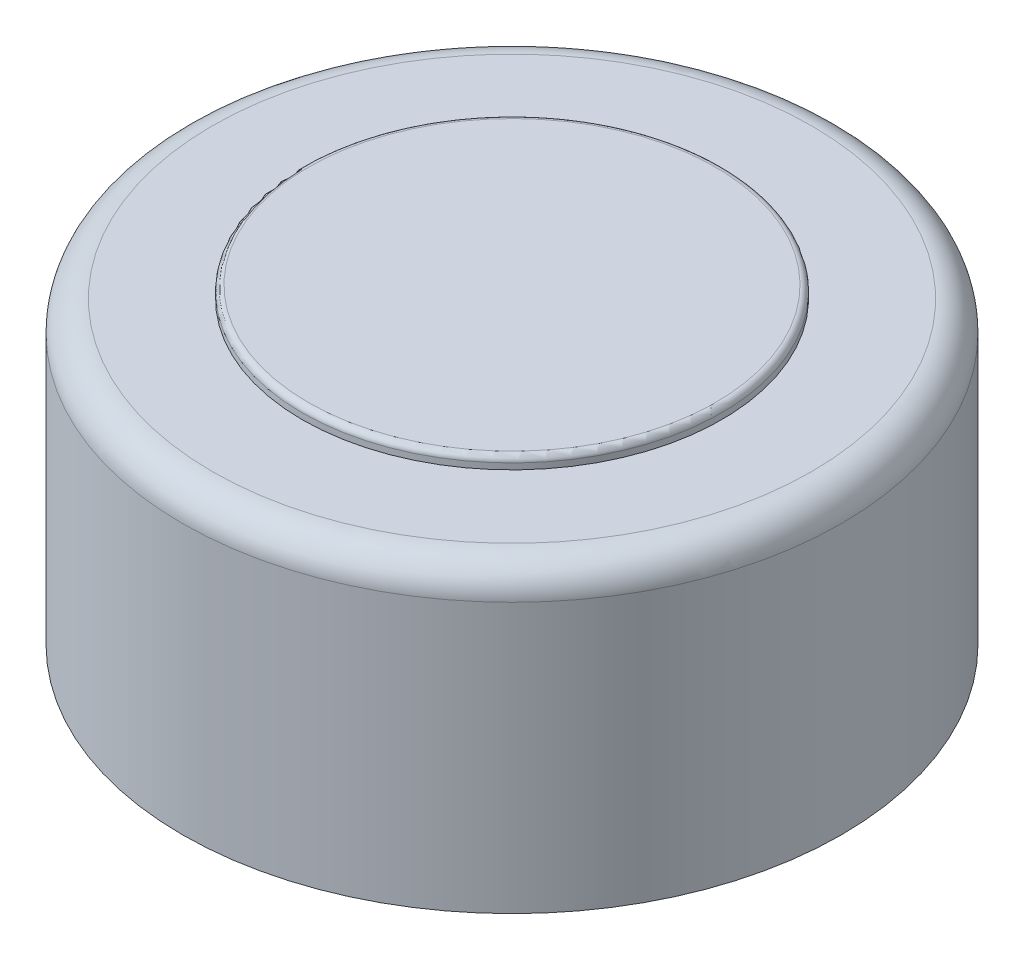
from build123d import *


with BuildPart() as part:
    # Esquisse1 → R_volution1 (revolve)
    with BuildSketch(Plane(origin=(0, 0, 0), x_dir=(0, 0, -1), z_dir=(1, 0, 0)), mode=Mode.PRIVATE) as r_volution1_sk:
        with BuildLine():
            Line((0, 0), (5.5, 0))
            Line((5.5, 0), (5.5, 4.5))
            ThreePointArc((5.5, 4.5), (5.353553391, 4.853553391), (5, 5))
            Line((5, 5), (3.5, 5))
            Line((3.5, 5), (3.5, 5.1))
            ThreePointArc((3.5, 5.1), (3.470710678, 5.170710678), (3.4, 5.2))
            Line((3.4, 5.2), (0, 5.2))
            Line((0, 5.2), (0, 0))
        make_face()
    revolve(r_volution1_sk.sketch.rotate(Axis((0, 23.053400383, 0), (0, -1, 0)), 180), axis=Axis((0, 23.053400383, 0), (0, -1, 0)))


solid = part.part
